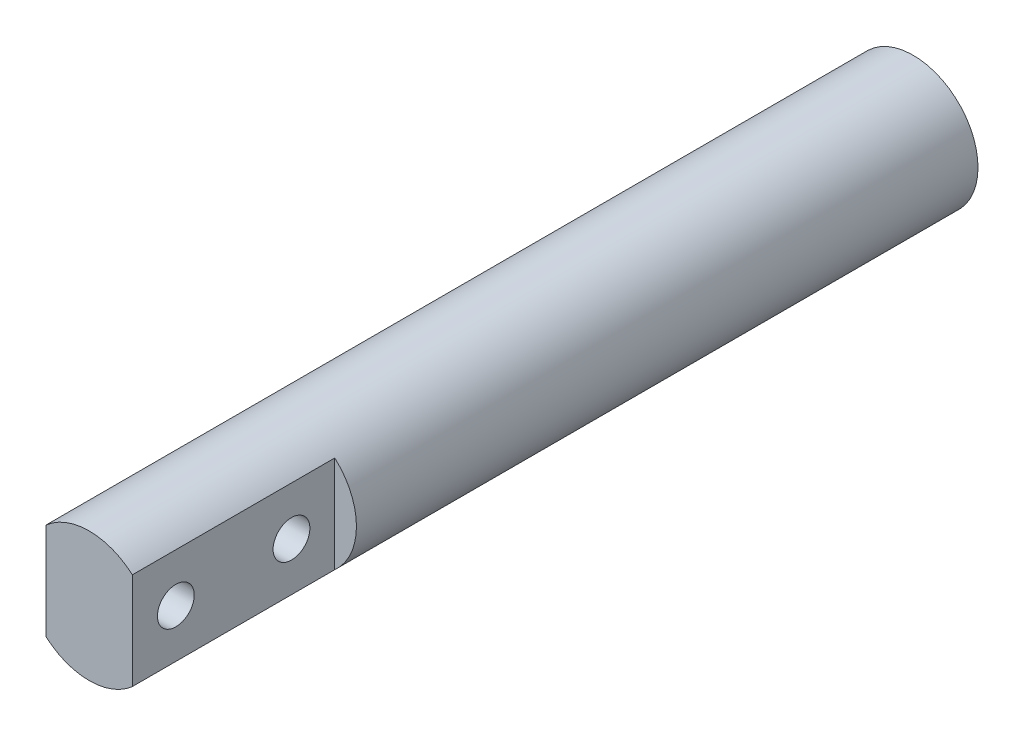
ISO-10303-21;
HEADER;
FILE_DESCRIPTION(('STEP AP214'),'2;1');
FILE_NAME('part.step','',(''),(''),'','','');
FILE_SCHEMA(('AUTOMOTIVE_DESIGN { 1 0 10303 214 1 1 1 1 }'));
ENDSEC;
DATA;
#1=APPLICATION_CONTEXT('core data for automotive mechanical design processes');
#2=APPLICATION_PROTOCOL_DEFINITION('international standard','automotive_design',2000,#1);
#3=PRODUCT_CONTEXT('',#1,'mechanical');
#4=PRODUCT('Part','Part','',(#3));
#5=PRODUCT_RELATED_PRODUCT_CATEGORY('part','',(#4));
#6=PRODUCT_DEFINITION_FORMATION('','',#4);
#7=PRODUCT_DEFINITION_CONTEXT('part definition',#1,'design');
#8=PRODUCT_DEFINITION('design','',#6,#7);
#9=PRODUCT_DEFINITION_SHAPE('','',#8);
#10=(LENGTH_UNIT() NAMED_UNIT(*) SI_UNIT(.MILLI.,.METRE.));
#11=(NAMED_UNIT(*) PLANE_ANGLE_UNIT() SI_UNIT($,.RADIAN.));
#12=(NAMED_UNIT(*) SI_UNIT($,.STERADIAN.) SOLID_ANGLE_UNIT());
#13=UNCERTAINTY_MEASURE_WITH_UNIT(LENGTH_MEASURE(1.E-05),#10,'distance_accuracy_value','');
#14=(GEOMETRIC_REPRESENTATION_CONTEXT(3) GLOBAL_UNCERTAINTY_ASSIGNED_CONTEXT((#13)) GLOBAL_UNIT_ASSIGNED_CONTEXT((#10,
#11,#12)) REPRESENTATION_CONTEXT('',''));
#15=CARTESIAN_POINT('',(0.,0.,0.));
#16=DIRECTION('',(0.,0.,1.));
#17=DIRECTION('',(1.,0.,0.));
#18=AXIS2_PLACEMENT_3D('',#15,#16,#17);
#19=CARTESIAN_POINT('',(0.,0.,-90.4748));
#20=DIRECTION('',(0.,0.,1.));
#21=DIRECTION('',(1.,0.,0.));
#22=AXIS2_PLACEMENT_3D('',#19,#20,#21);
#23=CYLINDRICAL_SURFACE('',#22,7.11835);
#24=DIRECTION('',(0.,0.,1.));
#25=VECTOR('',#24,1.);
#26=CARTESIAN_POINT('',(4.7371,-5.31326550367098,-90.4748));
#27=LINE('',#26,#25);
#28=CARTESIAN_POINT('',(4.7371,-5.31326550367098,0.));
#29=VERTEX_POINT('',#28);
#30=CARTESIAN_POINT('',(4.7371,-5.31326550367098,-22.225));
#31=VERTEX_POINT('',#30);
#32=EDGE_CURVE('E79',#29,#31,#27,.F.);
#33=ORIENTED_EDGE('',*,*,#32,.F.);
#34=CARTESIAN_POINT('',(0.,0.,0.));
#35=DIRECTION('',(0.,0.,1.));
#36=DIRECTION('',(1.,0.,0.));
#37=AXIS2_PLACEMENT_3D('',#34,#35,#36);
#38=CIRCLE('',#37,7.11835);
#39=CARTESIAN_POINT('',(-4.74345,-5.30759727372,0.));
#40=VERTEX_POINT('',#39);
#41=EDGE_CURVE('E89',#40,#29,#38,.T.);
#42=ORIENTED_EDGE('',*,*,#41,.F.);
#43=DIRECTION('',(0.,0.,1.));
#44=VECTOR('',#43,1.);
#45=CARTESIAN_POINT('',(-4.74345,-5.30759727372,-90.4748));
#46=LINE('',#45,#44);
#47=CARTESIAN_POINT('',(-4.74345,-5.30759727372,-22.225));
#48=VERTEX_POINT('',#47);
#49=EDGE_CURVE('E59',#48,#40,#46,.T.);
#50=ORIENTED_EDGE('',*,*,#49,.F.);
#51=CARTESIAN_POINT('',(0.,0.,-22.225));
#52=DIRECTION('',(0.,0.,1.));
#53=DIRECTION('',(1.,0.,0.));
#54=AXIS2_PLACEMENT_3D('',#51,#52,#53);
#55=CIRCLE('',#54,7.11835);
#56=CARTESIAN_POINT('',(-4.74345,5.30759727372,-22.225));
#57=VERTEX_POINT('',#56);
#58=EDGE_CURVE('E84',#48,#57,#55,.F.);
#59=ORIENTED_EDGE('',*,*,#58,.T.);
#60=DIRECTION('',(0.,0.,1.));
#61=VECTOR('',#60,1.);
#62=CARTESIAN_POINT('',(-4.74345,5.30759727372,-90.4748));
#63=LINE('',#62,#61);
#64=CARTESIAN_POINT('',(-4.74345,5.30759727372,0.));
#65=VERTEX_POINT('',#64);
#66=EDGE_CURVE('E99',#65,#57,#63,.F.);
#67=ORIENTED_EDGE('',*,*,#66,.F.);
#68=CARTESIAN_POINT('',(4.7371,5.31326550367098,0.));
#69=VERTEX_POINT('',#68);
#70=EDGE_CURVE('E95',#69,#65,#38,.T.);
#71=ORIENTED_EDGE('',*,*,#70,.F.);
#72=DIRECTION('',(0.,0.,1.));
#73=VECTOR('',#72,1.);
#74=CARTESIAN_POINT('',(4.7371,5.31326550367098,-90.4748));
#75=LINE('',#74,#73);
#76=CARTESIAN_POINT('',(4.7371,5.31326550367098,-22.225));
#77=VERTEX_POINT('',#76);
#78=EDGE_CURVE('E51',#77,#69,#75,.T.);
#79=ORIENTED_EDGE('',*,*,#78,.F.);
#80=CARTESIAN_POINT('',(0.,0.,-22.225));
#81=DIRECTION('',(0.,0.,1.));
#82=DIRECTION('',(1.,0.,0.));
#83=AXIS2_PLACEMENT_3D('',#80,#81,#82);
#84=CIRCLE('',#83,7.11835);
#85=EDGE_CURVE('E11',#77,#31,#84,.F.);
#86=ORIENTED_EDGE('',*,*,#85,.T.);
#87=EDGE_LOOP('',(#33,#42,#50,#59,#67,#71,#79,#86));
#88=FACE_BOUND('',#87,.T.);
#89=CARTESIAN_POINT('',(0.,0.,-90.4748));
#90=DIRECTION('',(0.,0.,1.));
#91=DIRECTION('',(1.,0.,0.));
#92=AXIS2_PLACEMENT_3D('',#89,#90,#91);
#93=CIRCLE('',#92,7.11835);
#94=CARTESIAN_POINT('',(7.11835,0.,-90.4748));
#95=VERTEX_POINT('',#94);
#96=EDGE_CURVE('E94',#95,#95,#93,.T.);
#97=ORIENTED_EDGE('',*,*,#96,.T.);
#98=EDGE_LOOP('',(#97));
#99=FACE_BOUND('',#98,.T.);
#100=ADVANCED_FACE('F35',(#88,#99),#23,.T.);
#101=CARTESIAN_POINT('',(0.,0.,-90.4748));
#102=DIRECTION('',(0.,0.,1.));
#103=DIRECTION('',(1.,0.,0.));
#104=AXIS2_PLACEMENT_3D('',#101,#102,#103);
#105=PLANE('',#104);
#106=ORIENTED_EDGE('',*,*,#96,.F.);
#107=EDGE_LOOP('',(#106));
#108=FACE_BOUND('',#107,.T.);
#109=ADVANCED_FACE('F138',(#108),#105,.F.);
#110=CARTESIAN_POINT('',(0.,0.,0.));
#111=DIRECTION('',(0.,0.,1.));
#112=DIRECTION('',(1.,0.,0.));
#113=AXIS2_PLACEMENT_3D('',#110,#111,#112);
#114=PLANE('',#113);
#115=DIRECTION('',(0.,-1.,0.));
#116=VECTOR('',#115,1.);
#117=CARTESIAN_POINT('',(4.7371,0.,0.));
#118=LINE('',#117,#116);
#119=EDGE_CURVE('E43',#69,#29,#118,.T.);
#120=ORIENTED_EDGE('',*,*,#119,.F.);
#121=ORIENTED_EDGE('',*,*,#70,.T.);
#122=DIRECTION('',(0.,1.,0.));
#123=VECTOR('',#122,1.);
#124=CARTESIAN_POINT('',(-4.74345,0.,0.));
#125=LINE('',#124,#123);
#126=EDGE_CURVE('E93',#40,#65,#125,.T.);
#127=ORIENTED_EDGE('',*,*,#126,.F.);
#128=ORIENTED_EDGE('',*,*,#41,.T.);
#129=EDGE_LOOP('',(#120,#121,#127,#128));
#130=FACE_BOUND('',#129,.T.);
#131=ADVANCED_FACE('F92',(#130),#114,.T.);
#132=CARTESIAN_POINT('',(-4.74345,6.65383686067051,-22.225));
#133=DIRECTION('',(1.,0.,0.));
#134=DIRECTION('',(0.,1.,0.));
#135=AXIS2_PLACEMENT_3D('',#132,#133,#134);
#136=PLANE('',#135);
#137=CARTESIAN_POINT('',(-4.74345,0.,-17.4752));
#138=DIRECTION('',(-1.,0.,0.));
#139=DIRECTION('',(0.,0.,1.));
#140=AXIS2_PLACEMENT_3D('',#137,#138,#139);
#141=CIRCLE('',#140,2.01929999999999);
#142=CARTESIAN_POINT('',(-4.74345,0.,-15.4559));
#143=VERTEX_POINT('',#142);
#144=EDGE_CURVE('E116',#143,#143,#141,.T.);
#145=ORIENTED_EDGE('',*,*,#144,.F.);
#146=EDGE_LOOP('',(#145));
#147=FACE_BOUND('',#146,.T.);
#148=CARTESIAN_POINT('',(-4.74345,0.,-4.7752));
#149=DIRECTION('',(-1.,0.,0.));
#150=DIRECTION('',(0.,0.,1.));
#151=AXIS2_PLACEMENT_3D('',#148,#149,#150);
#152=CIRCLE('',#151,2.01929999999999);
#153=CARTESIAN_POINT('',(-4.74345,0.,-2.75590000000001));
#154=VERTEX_POINT('',#153);
#155=EDGE_CURVE('E107',#154,#154,#152,.T.);
#156=ORIENTED_EDGE('',*,*,#155,.F.);
#157=EDGE_LOOP('',(#156));
#158=FACE_BOUND('',#157,.T.);
#159=ORIENTED_EDGE('',*,*,#66,.T.);
#160=DIRECTION('',(0.,1.,0.));
#161=VECTOR('',#160,1.);
#162=CARTESIAN_POINT('',(-4.74345,6.65383686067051,-22.225));
#163=LINE('',#162,#161);
#164=EDGE_CURVE('E90',#48,#57,#163,.T.);
#165=ORIENTED_EDGE('',*,*,#164,.F.);
#166=ORIENTED_EDGE('',*,*,#49,.T.);
#167=ORIENTED_EDGE('',*,*,#126,.T.);
#168=EDGE_LOOP('',(#159,#165,#166,#167));
#169=FACE_BOUND('',#168,.T.);
#170=ADVANCED_FACE('F123',(#147,#158,#169),#136,.F.);
#171=CARTESIAN_POINT('',(-8.0703684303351,-6.38705566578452,-22.225));
#172=DIRECTION('',(0.,0.,1.));
#173=DIRECTION('',(1.,0.,0.));
#174=AXIS2_PLACEMENT_3D('',#171,#172,#173);
#175=PLANE('',#174);
#176=ORIENTED_EDGE('',*,*,#164,.T.);
#177=ORIENTED_EDGE('',*,*,#58,.F.);
#178=EDGE_LOOP('',(#176,#177));
#179=FACE_BOUND('',#178,.T.);
#180=ADVANCED_FACE('F125',(#179),#175,.T.);
#181=CARTESIAN_POINT('',(4.7371,6.87353902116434,-22.225));
#182=DIRECTION('',(-1.,0.,0.));
#183=DIRECTION('',(0.,-1.,0.));
#184=AXIS2_PLACEMENT_3D('',#181,#182,#183);
#185=PLANE('',#184);
#186=CARTESIAN_POINT('',(4.7371,0.,-17.4752));
#187=DIRECTION('',(-1.,0.,0.));
#188=DIRECTION('',(0.,-1.,0.));
#189=AXIS2_PLACEMENT_3D('',#186,#187,#188);
#190=CIRCLE('',#189,2.01929999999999);
#191=CARTESIAN_POINT('',(4.7371,-2.01929999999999,-17.4752));
#192=VERTEX_POINT('',#191);
#193=EDGE_CURVE('E38',#192,#192,#190,.T.);
#194=ORIENTED_EDGE('',*,*,#193,.T.);
#195=EDGE_LOOP('',(#194));
#196=FACE_BOUND('',#195,.T.);
#197=CARTESIAN_POINT('',(4.7371,0.,-4.7752));
#198=DIRECTION('',(-1.,0.,0.));
#199=DIRECTION('',(0.,-1.,0.));
#200=AXIS2_PLACEMENT_3D('',#197,#198,#199);
#201=CIRCLE('',#200,2.01929999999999);
#202=CARTESIAN_POINT('',(4.7371,-2.01929999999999,-4.7752));
#203=VERTEX_POINT('',#202);
#204=EDGE_CURVE('E104',#203,#203,#201,.T.);
#205=ORIENTED_EDGE('',*,*,#204,.T.);
#206=EDGE_LOOP('',(#205));
#207=FACE_BOUND('',#206,.T.);
#208=ORIENTED_EDGE('',*,*,#32,.T.);
#209=DIRECTION('',(0.,-1.,0.));
#210=VECTOR('',#209,1.);
#211=CARTESIAN_POINT('',(4.7371,6.87353902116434,-22.225));
#212=LINE('',#211,#210);
#213=EDGE_CURVE('E106',#77,#31,#212,.T.);
#214=ORIENTED_EDGE('',*,*,#213,.F.);
#215=ORIENTED_EDGE('',*,*,#78,.T.);
#216=ORIENTED_EDGE('',*,*,#119,.T.);
#217=EDGE_LOOP('',(#208,#214,#215,#216));
#218=FACE_BOUND('',#217,.T.);
#219=ADVANCED_FACE('F78',(#196,#207,#218),#185,.F.);
#220=CARTESIAN_POINT('',(4.7371,-6.38705566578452,-22.225));
#221=DIRECTION('',(0.,0.,1.));
#222=DIRECTION('',(1.,0.,0.));
#223=AXIS2_PLACEMENT_3D('',#220,#221,#222);
#224=PLANE('',#223);
#225=ORIENTED_EDGE('',*,*,#213,.T.);
#226=ORIENTED_EDGE('',*,*,#85,.F.);
#227=EDGE_LOOP('',(#225,#226));
#228=FACE_BOUND('',#227,.T.);
#229=ADVANCED_FACE('F132',(#228),#224,.T.);
#230=CARTESIAN_POINT('',(-4.74345,0.,-4.7752));
#231=DIRECTION('',(-1.,0.,0.));
#232=DIRECTION('',(0.,0.,1.));
#233=AXIS2_PLACEMENT_3D('',#230,#231,#232);
#234=CYLINDRICAL_SURFACE('',#233,2.01929999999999);
#235=ORIENTED_EDGE('',*,*,#155,.T.);
#236=EDGE_LOOP('',(#235));
#237=FACE_BOUND('',#236,.T.);
#238=ORIENTED_EDGE('',*,*,#204,.F.);
#239=EDGE_LOOP('',(#238));
#240=FACE_BOUND('',#239,.T.);
#241=ADVANCED_FACE('F170',(#237,#240),#234,.F.);
#242=CARTESIAN_POINT('',(-4.74345,0.,-17.4752));
#243=DIRECTION('',(-1.,0.,0.));
#244=DIRECTION('',(0.,0.,1.));
#245=AXIS2_PLACEMENT_3D('',#242,#243,#244);
#246=CYLINDRICAL_SURFACE('',#245,2.01929999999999);
#247=ORIENTED_EDGE('',*,*,#144,.T.);
#248=EDGE_LOOP('',(#247));
#249=FACE_BOUND('',#248,.T.);
#250=ORIENTED_EDGE('',*,*,#193,.F.);
#251=EDGE_LOOP('',(#250));
#252=FACE_BOUND('',#251,.T.);
#253=ADVANCED_FACE('F176',(#249,#252),#246,.F.);
#254=CLOSED_SHELL('',(#100,#109,#131,#170,#180,#219,#229,#241,#253));
#255=MANIFOLD_SOLID_BREP('B2',#254);
#256=ADVANCED_BREP_SHAPE_REPRESENTATION('',(#18,#255),#14);
#257=SHAPE_DEFINITION_REPRESENTATION(#9,#256);
ENDSEC;
END-ISO-10303-21;
